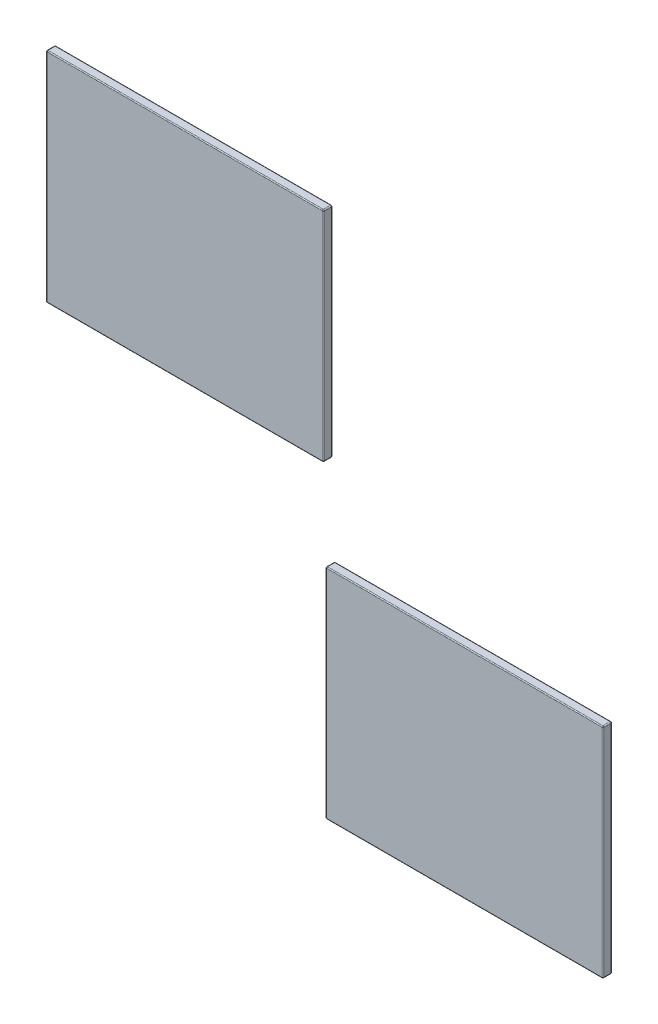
from build123d import *

# Parameters (mm, degrees)
ESQUISSE1_W          = 622.5
ESQUISSE1_H          = 490
BOSS_EXTRU_1_DEPTH   = 20
BOSS_EXTRU_1_2_DEPTH = 20
CONG_1_R             = 2.5
CONG_2_R             = 2.5
CONG_3_R             = 2
CONG_4_R             = 2


with BuildPart() as part:
    # Esquisse1 → Boss.-Extru.1 (new body)
    with BuildSketch(Plane.XY):
        with Locations((311.25, 245)):
            Rectangle(ESQUISSE1_W, ESQUISSE1_H)
    extrude(amount=-BOSS_EXTRU_1_DEPTH)

    # Cong_2
    cong_2_edges = [part.edges().sort_by_distance(p)[0] for p in [
        (0, 490, -10),
        (622.5, 490, -10),
        (622.5, 0, -10),
        (0, 0, -10),
    ]]
    fillet(cong_2_edges, radius=CONG_2_R)

    # Cong_4
    cong_4_edges = [part.edges().sort_by_distance(p)[0] for p in [
        (311.25, 0, 0),
        (311.25, 0, -20),
        (0, 245, 0),
        (622.5, 245, 0),
        (311.25, 490, 0),
        (621.767766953, 489.267766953, 0),
        (0.732233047, 489.267766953, 0),
        (0.732233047, 0.732233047, 0),
        (621.767766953, 0.732233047, 0),
        (622.5, 245, -20),
        (0, 245, -20),
        (311.25, 490, -20),
        (621.767766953, 489.267766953, -20),
        (0.732233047, 489.267766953, -20),
        (0.732233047, 0.732233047, -20),
        (621.767766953, 0.732233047, -20),
    ]]
    fillet(cong_4_edges, radius=CONG_4_R)


with BuildPart() as body_2:
    # Esquisse1 → Boss.-Extru.1 2 (new body)
    with BuildSketch(Plane.XY):
        with Locations((-316.25, 935)):
            Rectangle(ESQUISSE1_W, ESQUISSE1_H)
    extrude(amount=-BOSS_EXTRU_1_2_DEPTH)

    # Cong_1
    cong_1_edges = [body_2.edges().sort_by_distance(p)[0] for p in [
        (-5, 690, -10),
        (-627.5, 690, -10),
        (-627.5, 1180, -10),
        (-5, 1180, -10),
    ]]
    fillet(cong_1_edges, radius=CONG_1_R)

    # Cong_3
    cong_3_edges = [body_2.edges().sort_by_distance(p)[0] for p in [
        (-627.5, 935, 0),
        (-627.5, 935, -20),
        (-5, 935, 0),
        (-316.25, 1180, 0),
        (-316.25, 690, 0),
        (-5.732233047, 1179.267766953, 0),
        (-5.732233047, 690.732233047, 0),
        (-626.767766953, 1179.267766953, 0),
        (-626.767766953, 690.732233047, 0),
        (-316.25, 690, -20),
        (-5, 935, -20),
        (-316.25, 1180, -20),
        (-5.732233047, 1179.267766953, -20),
        (-5.732233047, 690.732233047, -20),
        (-626.767766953, 1179.267766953, -20),
        (-626.767766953, 690.732233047, -20),
    ]]
    fillet(cong_3_edges, radius=CONG_3_R)


solid = Compound([part.part, body_2.part])
